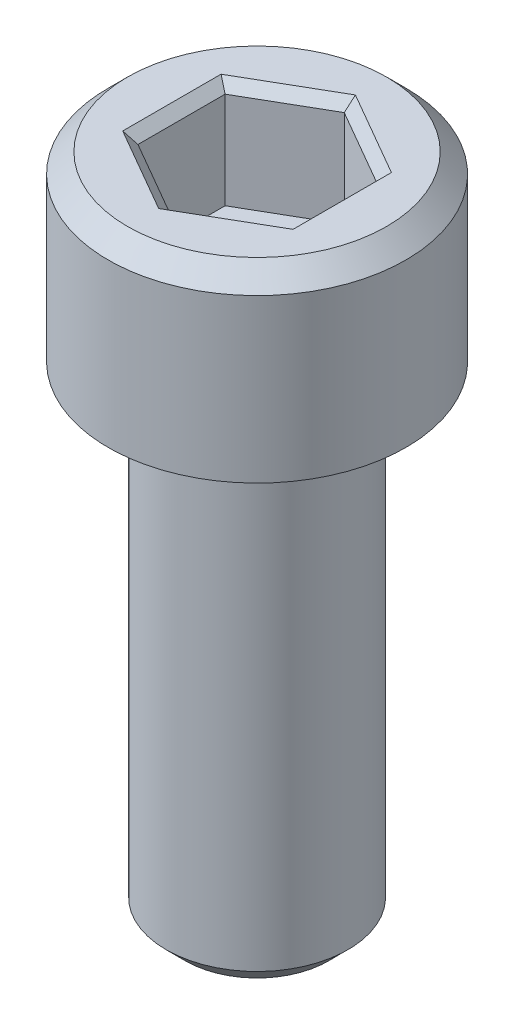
ISO-10303-21;
HEADER;
FILE_DESCRIPTION(('STEP AP214'),'2;1');
FILE_NAME('part.step','',(''),(''),'','','');
FILE_SCHEMA(('AUTOMOTIVE_DESIGN { 1 0 10303 214 1 1 1 1 }'));
ENDSEC;
DATA;
#1=APPLICATION_CONTEXT('core data for automotive mechanical design processes');
#2=APPLICATION_PROTOCOL_DEFINITION('international standard','automotive_design',2000,#1);
#3=PRODUCT_CONTEXT('',#1,'mechanical');
#4=PRODUCT('Part','Part','',(#3));
#5=PRODUCT_RELATED_PRODUCT_CATEGORY('part','',(#4));
#6=PRODUCT_DEFINITION_FORMATION('','',#4);
#7=PRODUCT_DEFINITION_CONTEXT('part definition',#1,'design');
#8=PRODUCT_DEFINITION('design','',#6,#7);
#9=PRODUCT_DEFINITION_SHAPE('','',#8);
#10=(LENGTH_UNIT() NAMED_UNIT(*) SI_UNIT(.MILLI.,.METRE.));
#11=(NAMED_UNIT(*) PLANE_ANGLE_UNIT() SI_UNIT($,.RADIAN.));
#12=(NAMED_UNIT(*) SI_UNIT($,.STERADIAN.) SOLID_ANGLE_UNIT());
#13=UNCERTAINTY_MEASURE_WITH_UNIT(LENGTH_MEASURE(1.E-05),#10,'distance_accuracy_value','');
#14=(GEOMETRIC_REPRESENTATION_CONTEXT(3) GLOBAL_UNCERTAINTY_ASSIGNED_CONTEXT((#13)) GLOBAL_UNIT_ASSIGNED_CONTEXT((#10,
#11,#12)) REPRESENTATION_CONTEXT('',''));
#15=CARTESIAN_POINT('',(0.,0.,0.));
#16=DIRECTION('',(0.,0.,1.));
#17=DIRECTION('',(1.,0.,0.));
#18=AXIS2_PLACEMENT_3D('',#15,#16,#17);
#19=CARTESIAN_POINT('',(-3.96874999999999,-2.794,0.));
#20=DIRECTION('',(0.,-1.,0.));
#21=DIRECTION('',(0.,0.,-1.));
#22=AXIS2_PLACEMENT_3D('',#19,#20,#21);
#23=PLANE('',#22);
#24=DIRECTION('',(-0.866025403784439,0.,0.5));
#25=VECTOR('',#24,1.);
#26=CARTESIAN_POINT('',(1.98437500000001,-2.794,1.14567944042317));
#27=LINE('',#26,#25);
#28=CARTESIAN_POINT('',(1.98437500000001,-2.794,1.14567944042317));
#29=VERTEX_POINT('',#28);
#30=CARTESIAN_POINT('',(0.,-2.794,2.29135888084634));
#31=VERTEX_POINT('',#30);
#32=EDGE_CURVE('E86',#29,#31,#27,.T.);
#33=ORIENTED_EDGE('',*,*,#32,.F.);
#34=DIRECTION('',(0.,0.,1.));
#35=VECTOR('',#34,1.);
#36=CARTESIAN_POINT('',(1.98437500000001,-2.794,-1.14567944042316));
#37=LINE('',#36,#35);
#38=CARTESIAN_POINT('',(1.98437500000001,-2.794,-1.14567944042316));
#39=VERTEX_POINT('',#38);
#40=EDGE_CURVE('E91',#39,#29,#37,.T.);
#41=ORIENTED_EDGE('',*,*,#40,.F.);
#42=DIRECTION('',(0.866025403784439,0.,0.5));
#43=VECTOR('',#42,1.);
#44=CARTESIAN_POINT('',(0.,-2.794,-2.29135888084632));
#45=LINE('',#44,#43);
#46=CARTESIAN_POINT('',(0.,-2.794,-2.29135888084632));
#47=VERTEX_POINT('',#46);
#48=EDGE_CURVE('E176',#47,#39,#45,.T.);
#49=ORIENTED_EDGE('',*,*,#48,.F.);
#50=DIRECTION('',(0.866025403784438,0.,-0.5));
#51=VECTOR('',#50,1.);
#52=CARTESIAN_POINT('',(-1.98437499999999,-2.794,-1.14567944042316));
#53=LINE('',#52,#51);
#54=CARTESIAN_POINT('',(-1.984375,-2.794,-1.14567944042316));
#55=VERTEX_POINT('',#54);
#56=EDGE_CURVE('E182',#55,#47,#53,.T.);
#57=ORIENTED_EDGE('',*,*,#56,.F.);
#58=DIRECTION('',(0.,0.,-1.));
#59=VECTOR('',#58,1.);
#60=CARTESIAN_POINT('',(-1.984375,-2.794,1.14567944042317));
#61=LINE('',#60,#59);
#62=CARTESIAN_POINT('',(-1.984375,-2.794,1.14567944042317));
#63=VERTEX_POINT('',#62);
#64=EDGE_CURVE('E187',#63,#55,#61,.T.);
#65=ORIENTED_EDGE('',*,*,#64,.F.);
#66=DIRECTION('',(-0.866025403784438,0.,-0.5));
#67=VECTOR('',#66,1.);
#68=CARTESIAN_POINT('',(0.,-2.794,2.29135888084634));
#69=LINE('',#68,#67);
#70=EDGE_CURVE('E102',#31,#63,#69,.T.);
#71=ORIENTED_EDGE('',*,*,#70,.F.);
#72=EDGE_LOOP('',(#33,#41,#49,#57,#65,#71));
#73=FACE_BOUND('',#72,.T.);
#74=ADVANCED_FACE('F17',(#73),#23,.F.);
#75=CARTESIAN_POINT('',(1.98437500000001,-2.794,-1.14567944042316));
#76=DIRECTION('',(-1.,0.,0.));
#77=DIRECTION('',(0.,0.,1.));
#78=AXIS2_PLACEMENT_3D('',#75,#76,#77);
#79=PLANE('',#78);
#80=DIRECTION('',(0.,1.,0.));
#81=VECTOR('',#80,1.);
#82=CARTESIAN_POINT('',(1.98437500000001,-2.794,-1.14567944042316));
#83=LINE('',#82,#81);
#84=CARTESIAN_POINT('',(1.98437500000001,-0.254,-1.14567944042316));
#85=VERTEX_POINT('',#84);
#86=EDGE_CURVE('E96',#39,#85,#83,.T.);
#87=ORIENTED_EDGE('',*,*,#86,.F.);
#88=ORIENTED_EDGE('',*,*,#40,.T.);
#89=DIRECTION('',(0.,1.,0.));
#90=VECTOR('',#89,1.);
#91=CARTESIAN_POINT('',(1.98437500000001,-2.794,1.14567944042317));
#92=LINE('',#91,#90);
#93=CARTESIAN_POINT('',(1.98437500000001,-0.254,1.14567944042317));
#94=VERTEX_POINT('',#93);
#95=EDGE_CURVE('E93',#94,#29,#92,.F.);
#96=ORIENTED_EDGE('',*,*,#95,.F.);
#97=DIRECTION('',(0.,0.,1.));
#98=VECTOR('',#97,1.);
#99=CARTESIAN_POINT('',(1.98437500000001,-0.254,0.));
#100=LINE('',#99,#98);
#101=EDGE_CURVE('E174',#94,#85,#100,.F.);
#102=ORIENTED_EDGE('',*,*,#101,.T.);
#103=EDGE_LOOP('',(#87,#88,#96,#102));
#104=FACE_BOUND('',#103,.T.);
#105=ADVANCED_FACE('F92',(#104),#79,.T.);
#106=CARTESIAN_POINT('',(1.98437500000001,-2.794,1.14567944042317));
#107=DIRECTION('',(-0.5,0.,-0.866025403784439));
#108=DIRECTION('',(-0.866025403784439,0.,0.5));
#109=AXIS2_PLACEMENT_3D('',#106,#107,#108);
#110=PLANE('',#109);
#111=ORIENTED_EDGE('',*,*,#95,.T.);
#112=ORIENTED_EDGE('',*,*,#32,.T.);
#113=DIRECTION('',(0.,1.,0.));
#114=VECTOR('',#113,1.);
#115=CARTESIAN_POINT('',(0.,-2.794,2.29135888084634));
#116=LINE('',#115,#114);
#117=CARTESIAN_POINT('',(0.,-0.253999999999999,2.29135888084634));
#118=VERTEX_POINT('',#117);
#119=EDGE_CURVE('E104',#118,#31,#116,.F.);
#120=ORIENTED_EDGE('',*,*,#119,.F.);
#121=DIRECTION('',(0.866025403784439,0.,-0.5));
#122=VECTOR('',#121,1.);
#123=CARTESIAN_POINT('',(0.,-0.253999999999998,2.29135888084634));
#124=LINE('',#123,#122);
#125=EDGE_CURVE('E108',#118,#94,#124,.T.);
#126=ORIENTED_EDGE('',*,*,#125,.T.);
#127=EDGE_LOOP('',(#111,#112,#120,#126));
#128=FACE_BOUND('',#127,.T.);
#129=ADVANCED_FACE('F106',(#128),#110,.T.);
#130=CARTESIAN_POINT('',(0.,-2.794,2.29135888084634));
#131=DIRECTION('',(0.5,0.,-0.866025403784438));
#132=DIRECTION('',(-0.866025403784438,0.,-0.5));
#133=AXIS2_PLACEMENT_3D('',#130,#131,#132);
#134=PLANE('',#133);
#135=ORIENTED_EDGE('',*,*,#119,.T.);
#136=ORIENTED_EDGE('',*,*,#70,.T.);
#137=DIRECTION('',(0.,1.,0.));
#138=VECTOR('',#137,1.);
#139=CARTESIAN_POINT('',(-1.984375,-2.794,1.14567944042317));
#140=LINE('',#139,#138);
#141=CARTESIAN_POINT('',(-1.984375,-0.254,1.14567944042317));
#142=VERTEX_POINT('',#141);
#143=EDGE_CURVE('E189',#142,#63,#140,.F.);
#144=ORIENTED_EDGE('',*,*,#143,.F.);
#145=DIRECTION('',(0.866025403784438,0.,0.500000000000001));
#146=VECTOR('',#145,1.);
#147=CARTESIAN_POINT('',(-1.984375,-0.254,1.14567944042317));
#148=LINE('',#147,#146);
#149=EDGE_CURVE('E168',#142,#118,#148,.T.);
#150=ORIENTED_EDGE('',*,*,#149,.T.);
#151=EDGE_LOOP('',(#135,#136,#144,#150));
#152=FACE_BOUND('',#151,.T.);
#153=ADVANCED_FACE('F193',(#152),#134,.T.);
#154=CARTESIAN_POINT('',(-1.984375,-2.794,1.14567944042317));
#155=DIRECTION('',(1.,0.,0.));
#156=DIRECTION('',(0.,0.,-1.));
#157=AXIS2_PLACEMENT_3D('',#154,#155,#156);
#158=PLANE('',#157);
#159=ORIENTED_EDGE('',*,*,#143,.T.);
#160=ORIENTED_EDGE('',*,*,#64,.T.);
#161=DIRECTION('',(0.,1.,0.));
#162=VECTOR('',#161,1.);
#163=CARTESIAN_POINT('',(-1.984375,-2.794,-1.14567944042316));
#164=LINE('',#163,#162);
#165=CARTESIAN_POINT('',(-1.984375,-0.253999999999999,-1.14567944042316));
#166=VERTEX_POINT('',#165);
#167=EDGE_CURVE('E184',#166,#55,#164,.F.);
#168=ORIENTED_EDGE('',*,*,#167,.F.);
#169=DIRECTION('',(0.,0.,1.));
#170=VECTOR('',#169,1.);
#171=CARTESIAN_POINT('',(-1.984375,-0.254,0.));
#172=LINE('',#171,#170);
#173=EDGE_CURVE('E163',#166,#142,#172,.T.);
#174=ORIENTED_EDGE('',*,*,#173,.T.);
#175=EDGE_LOOP('',(#159,#160,#168,#174));
#176=FACE_BOUND('',#175,.T.);
#177=ADVANCED_FACE('F223',(#176),#158,.T.);
#178=CARTESIAN_POINT('',(-1.98437499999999,-2.794,-1.14567944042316));
#179=DIRECTION('',(0.5,0.,0.866025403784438));
#180=DIRECTION('',(0.866025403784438,0.,-0.5));
#181=AXIS2_PLACEMENT_3D('',#178,#179,#180);
#182=PLANE('',#181);
#183=ORIENTED_EDGE('',*,*,#167,.T.);
#184=ORIENTED_EDGE('',*,*,#56,.T.);
#185=DIRECTION('',(0.,1.,0.));
#186=VECTOR('',#185,1.);
#187=CARTESIAN_POINT('',(0.,-2.794,-2.29135888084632));
#188=LINE('',#187,#186);
#189=CARTESIAN_POINT('',(0.,-0.254,-2.29135888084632));
#190=VERTEX_POINT('',#189);
#191=EDGE_CURVE('E178',#190,#47,#188,.F.);
#192=ORIENTED_EDGE('',*,*,#191,.F.);
#193=DIRECTION('',(-0.866025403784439,0.,0.499999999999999));
#194=VECTOR('',#193,1.);
#195=CARTESIAN_POINT('',(0.,-0.253999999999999,-2.29135888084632));
#196=LINE('',#195,#194);
#197=EDGE_CURVE('E158',#190,#166,#196,.T.);
#198=ORIENTED_EDGE('',*,*,#197,.T.);
#199=EDGE_LOOP('',(#183,#184,#192,#198));
#200=FACE_BOUND('',#199,.T.);
#201=ADVANCED_FACE('F219',(#200),#182,.T.);
#202=CARTESIAN_POINT('',(0.,-2.794,-2.29135888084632));
#203=DIRECTION('',(-0.5,0.,0.866025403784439));
#204=DIRECTION('',(0.866025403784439,0.,0.5));
#205=AXIS2_PLACEMENT_3D('',#202,#203,#204);
#206=PLANE('',#205);
#207=ORIENTED_EDGE('',*,*,#191,.T.);
#208=ORIENTED_EDGE('',*,*,#48,.T.);
#209=ORIENTED_EDGE('',*,*,#86,.T.);
#210=DIRECTION('',(-0.866025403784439,0.,-0.499999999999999));
#211=VECTOR('',#210,1.);
#212=CARTESIAN_POINT('',(1.98437500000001,-0.253999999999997,-1.14567944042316));
#213=LINE('',#212,#211);
#214=EDGE_CURVE('E150',#85,#190,#213,.T.);
#215=ORIENTED_EDGE('',*,*,#214,.T.);
#216=EDGE_LOOP('',(#207,#208,#209,#215));
#217=FACE_BOUND('',#216,.T.);
#218=ADVANCED_FACE('F214',(#217),#206,.T.);
#219=CARTESIAN_POINT('',(2.23837500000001,0.,0.));
#220=DIRECTION('',(0.707106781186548,-0.707106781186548,0.));
#221=DIRECTION('',(0.707106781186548,0.707106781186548,0.));
#222=AXIS2_PLACEMENT_3D('',#219,#220,#221);
#223=PLANE('',#222);
#224=ORIENTED_EDGE('',*,*,#101,.F.);
#225=DIRECTION('',(0.654653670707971,0.654653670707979,0.377964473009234));
#226=VECTOR('',#225,1.);
#227=CARTESIAN_POINT('',(1.98437500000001,-0.254,1.14567944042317));
#228=LINE('',#227,#226);
#229=CARTESIAN_POINT('',(2.23837500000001,0.,1.29232640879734));
#230=VERTEX_POINT('',#229);
#231=EDGE_CURVE('E171',#94,#230,#228,.T.);
#232=ORIENTED_EDGE('',*,*,#231,.T.);
#233=DIRECTION('',(0.,0.,1.));
#234=VECTOR('',#233,1.);
#235=CARTESIAN_POINT('',(2.23837500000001,0.,0.));
#236=LINE('',#235,#234);
#237=CARTESIAN_POINT('',(2.23837500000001,0.,-1.29232640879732));
#238=VERTEX_POINT('',#237);
#239=EDGE_CURVE('E146',#238,#230,#236,.T.);
#240=ORIENTED_EDGE('',*,*,#239,.F.);
#241=DIRECTION('',(-0.654653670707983,-0.654653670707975,0.377964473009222));
#242=VECTOR('',#241,1.);
#243=CARTESIAN_POINT('',(2.23837500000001,0.,-1.29232640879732));
#244=LINE('',#243,#242);
#245=EDGE_CURVE('E153',#238,#85,#244,.T.);
#246=ORIENTED_EDGE('',*,*,#245,.T.);
#247=EDGE_LOOP('',(#224,#232,#240,#246));
#248=FACE_BOUND('',#247,.T.);
#249=ADVANCED_FACE('F209',(#248),#223,.F.);
#250=CARTESIAN_POINT('',(1.11918750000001,0.,1.938489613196));
#251=DIRECTION('',(0.353553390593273,-0.707106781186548,0.612372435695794));
#252=DIRECTION('',(0.,-0.654653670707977,-0.755928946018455));
#253=AXIS2_PLACEMENT_3D('',#250,#251,#252);
#254=PLANE('',#253);
#255=ORIENTED_EDGE('',*,*,#125,.F.);
#256=DIRECTION('',(0.,-0.654653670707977,-0.755928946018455));
#257=VECTOR('',#256,1.);
#258=CARTESIAN_POINT('',(0.,-0.319767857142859,2.21541670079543));
#259=LINE('',#258,#257);
#260=CARTESIAN_POINT('',(0.,0.,2.58465281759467));
#261=VERTEX_POINT('',#260);
#262=EDGE_CURVE('E166',#118,#261,#259,.F.);
#263=ORIENTED_EDGE('',*,*,#262,.T.);
#264=DIRECTION('',(-0.866025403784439,0.,0.5));
#265=VECTOR('',#264,1.);
#266=CARTESIAN_POINT('',(2.23837500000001,0.,1.29232640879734));
#267=LINE('',#266,#265);
#268=EDGE_CURVE('E143',#230,#261,#267,.T.);
#269=ORIENTED_EDGE('',*,*,#268,.F.);
#270=ORIENTED_EDGE('',*,*,#231,.F.);
#271=EDGE_LOOP('',(#255,#263,#269,#270));
#272=FACE_BOUND('',#271,.T.);
#273=ADVANCED_FACE('F200',(#272),#254,.F.);
#274=CARTESIAN_POINT('',(-1.1191875,0.,1.938489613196));
#275=DIRECTION('',(-0.353553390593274,-0.707106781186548,0.612372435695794));
#276=DIRECTION('',(0.,-0.654653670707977,-0.755928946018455));
#277=AXIS2_PLACEMENT_3D('',#274,#275,#276);
#278=PLANE('',#277);
#279=DIRECTION('',(-0.866025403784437,0.,-0.500000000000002));
#280=VECTOR('',#279,1.);
#281=CARTESIAN_POINT('',(0.,0.,2.58465281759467));
#282=LINE('',#281,#280);
#283=CARTESIAN_POINT('',(-2.238375,0.,1.29232640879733));
#284=VERTEX_POINT('',#283);
#285=EDGE_CURVE('E140',#261,#284,#282,.T.);
#286=ORIENTED_EDGE('',*,*,#285,.F.);
#287=ORIENTED_EDGE('',*,*,#262,.F.);
#288=ORIENTED_EDGE('',*,*,#149,.F.);
#289=DIRECTION('',(-0.65465367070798,0.65465367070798,0.377964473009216));
#290=VECTOR('',#289,1.);
#291=CARTESIAN_POINT('',(-1.984375,-0.254,1.14567944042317));
#292=LINE('',#291,#290);
#293=EDGE_CURVE('E161',#142,#284,#292,.T.);
#294=ORIENTED_EDGE('',*,*,#293,.T.);
#295=EDGE_LOOP('',(#286,#287,#288,#294));
#296=FACE_BOUND('',#295,.T.);
#297=ADVANCED_FACE('F203',(#296),#278,.F.);
#298=CARTESIAN_POINT('',(-2.238375,0.,0.));
#299=DIRECTION('',(-0.707106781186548,-0.707106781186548,0.));
#300=DIRECTION('',(0.707106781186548,-0.707106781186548,0.));
#301=AXIS2_PLACEMENT_3D('',#298,#299,#300);
#302=PLANE('',#301);
#303=DIRECTION('',(0.,0.,1.));
#304=VECTOR('',#303,1.);
#305=CARTESIAN_POINT('',(-2.238375,0.,0.));
#306=LINE('',#305,#304);
#307=CARTESIAN_POINT('',(-2.238375,0.,-1.29232640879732));
#308=VERTEX_POINT('',#307);
#309=EDGE_CURVE('E137',#284,#308,#306,.F.);
#310=ORIENTED_EDGE('',*,*,#309,.F.);
#311=ORIENTED_EDGE('',*,*,#293,.F.);
#312=ORIENTED_EDGE('',*,*,#173,.F.);
#313=DIRECTION('',(-0.654653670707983,0.654653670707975,-0.377964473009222));
#314=VECTOR('',#313,1.);
#315=CARTESIAN_POINT('',(-1.984375,-0.253999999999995,-1.14567944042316));
#316=LINE('',#315,#314);
#317=EDGE_CURVE('E156',#166,#308,#316,.T.);
#318=ORIENTED_EDGE('',*,*,#317,.T.);
#319=EDGE_LOOP('',(#310,#311,#312,#318));
#320=FACE_BOUND('',#319,.T.);
#321=ADVANCED_FACE('F221',(#320),#302,.F.);
#322=CARTESIAN_POINT('',(-1.1191875,0.,-1.93848961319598));
#323=DIRECTION('',(-0.353553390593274,-0.707106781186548,-0.612372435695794));
#324=DIRECTION('',(0.,0.654653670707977,-0.755928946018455));
#325=AXIS2_PLACEMENT_3D('',#322,#323,#324);
#326=PLANE('',#325);
#327=ORIENTED_EDGE('',*,*,#197,.F.);
#328=DIRECTION('',(0.,0.654653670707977,-0.755928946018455));
#329=VECTOR('',#328,1.);
#330=CARTESIAN_POINT('',(0.,-0.319767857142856,-2.21541670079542));
#331=LINE('',#330,#329);
#332=CARTESIAN_POINT('',(0.,0.,-2.58465281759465));
#333=VERTEX_POINT('',#332);
#334=EDGE_CURVE('E35',#190,#333,#331,.T.);
#335=ORIENTED_EDGE('',*,*,#334,.T.);
#336=DIRECTION('',(0.866025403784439,0.,-0.499999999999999));
#337=VECTOR('',#336,1.);
#338=CARTESIAN_POINT('',(-2.238375,0.,-1.29232640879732));
#339=LINE('',#338,#337);
#340=EDGE_CURVE('E134',#308,#333,#339,.T.);
#341=ORIENTED_EDGE('',*,*,#340,.F.);
#342=ORIENTED_EDGE('',*,*,#317,.F.);
#343=EDGE_LOOP('',(#327,#335,#341,#342));
#344=FACE_BOUND('',#343,.T.);
#345=ADVANCED_FACE('F216',(#344),#326,.F.);
#346=CARTESIAN_POINT('',(1.1191875,0.,-1.93848961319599));
#347=DIRECTION('',(0.353553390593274,-0.707106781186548,-0.612372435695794));
#348=DIRECTION('',(0.,0.654653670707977,-0.755928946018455));
#349=AXIS2_PLACEMENT_3D('',#346,#347,#348);
#350=PLANE('',#349);
#351=ORIENTED_EDGE('',*,*,#214,.F.);
#352=ORIENTED_EDGE('',*,*,#245,.F.);
#353=DIRECTION('',(0.866025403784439,0.,0.5));
#354=VECTOR('',#353,1.);
#355=CARTESIAN_POINT('',(0.,0.,-2.58465281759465));
#356=LINE('',#355,#354);
#357=EDGE_CURVE('E125',#333,#238,#356,.T.);
#358=ORIENTED_EDGE('',*,*,#357,.F.);
#359=ORIENTED_EDGE('',*,*,#334,.F.);
#360=EDGE_LOOP('',(#351,#352,#358,#359));
#361=FACE_BOUND('',#360,.T.);
#362=ADVANCED_FACE('F212',(#361),#350,.F.);
#363=CARTESIAN_POINT('',(0.,0.,0.));
#364=DIRECTION('',(0.,1.,0.));
#365=DIRECTION('',(0.,0.,1.));
#366=AXIS2_PLACEMENT_3D('',#363,#364,#365);
#367=PLANE('',#366);
#368=CARTESIAN_POINT('',(0.,0.,0.));
#369=DIRECTION('',(0.,-1.,0.));
#370=DIRECTION('',(0.,0.,-1.));
#371=AXIS2_PLACEMENT_3D('',#368,#369,#370);
#372=CIRCLE('',#371,3.40360000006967);
#373=CARTESIAN_POINT('',(0.,0.,-3.40360000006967));
#374=VERTEX_POINT('',#373);
#375=EDGE_CURVE('E20',#374,#374,#372,.T.);
#376=ORIENTED_EDGE('',*,*,#375,.F.);
#377=EDGE_LOOP('',(#376));
#378=FACE_BOUND('',#377,.T.);
#379=ORIENTED_EDGE('',*,*,#340,.T.);
#380=ORIENTED_EDGE('',*,*,#357,.T.);
#381=ORIENTED_EDGE('',*,*,#239,.T.);
#382=ORIENTED_EDGE('',*,*,#268,.T.);
#383=ORIENTED_EDGE('',*,*,#285,.T.);
#384=ORIENTED_EDGE('',*,*,#309,.T.);
#385=EDGE_LOOP('',(#379,#380,#381,#382,#383,#384));
#386=FACE_BOUND('',#385,.T.);
#387=ADVANCED_FACE('F206',(#378,#386),#367,.T.);
#388=CARTESIAN_POINT('',(0.,-0.507999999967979,0.));
#389=DIRECTION('',(0.,-1.,0.));
#390=DIRECTION('',(0.,0.,-1.));
#391=AXIS2_PLACEMENT_3D('',#388,#389,#390);
#392=CONICAL_SURFACE('',#391,3.91160000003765,0.785398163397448);
#393=ORIENTED_EDGE('',*,*,#375,.T.);
#394=EDGE_LOOP('',(#393));
#395=FACE_BOUND('',#394,.T.);
#396=CARTESIAN_POINT('',(0.,-0.508,0.));
#397=DIRECTION('',(0.,-1.,0.));
#398=DIRECTION('',(0.,0.,-1.));
#399=AXIS2_PLACEMENT_3D('',#396,#397,#398);
#400=CIRCLE('',#399,3.9116);
#401=CARTESIAN_POINT('',(0.,-0.508,-3.9116));
#402=VERTEX_POINT('',#401);
#403=EDGE_CURVE('E117',#402,#402,#400,.T.);
#404=ORIENTED_EDGE('',*,*,#403,.F.);
#405=EDGE_LOOP('',(#404));
#406=FACE_BOUND('',#405,.T.);
#407=ADVANCED_FACE('F257',(#395,#406),#392,.T.);
#408=CARTESIAN_POINT('',(0.,-17.4752,0.));
#409=DIRECTION('',(0.,1.,0.));
#410=DIRECTION('',(0.,0.,1.));
#411=AXIS2_PLACEMENT_3D('',#408,#409,#410);
#412=PLANE('',#411);
#413=CARTESIAN_POINT('',(0.,-17.4752000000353,0.));
#414=DIRECTION('',(0.,1.,0.));
#415=DIRECTION('',(0.,0.,1.));
#416=AXIS2_PLACEMENT_3D('',#413,#414,#415);
#417=CIRCLE('',#416,1.87959999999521);
#418=CARTESIAN_POINT('',(0.,-17.4752000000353,1.87959999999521));
#419=VERTEX_POINT('',#418);
#420=EDGE_CURVE('E115',#419,#419,#417,.T.);
#421=ORIENTED_EDGE('',*,*,#420,.F.);
#422=EDGE_LOOP('',(#421));
#423=FACE_BOUND('',#422,.T.);
#424=ADVANCED_FACE('F253',(#423),#412,.F.);
#425=CARTESIAN_POINT('',(0.,-4.7752,0.));
#426=DIRECTION('',(0.,-1.,0.));
#427=DIRECTION('',(0.,0.,-1.));
#428=AXIS2_PLACEMENT_3D('',#425,#426,#427);
#429=CYLINDRICAL_SURFACE('',#428,3.9116);
#430=CARTESIAN_POINT('',(0.,-4.7752,0.));
#431=DIRECTION('',(0.,-1.,0.));
#432=DIRECTION('',(0.,0.,-1.));
#433=AXIS2_PLACEMENT_3D('',#430,#431,#432);
#434=CIRCLE('',#433,3.9116);
#435=CARTESIAN_POINT('',(0.,-4.7752,-3.9116));
#436=VERTEX_POINT('',#435);
#437=EDGE_CURVE('E113',#436,#436,#434,.F.);
#438=ORIENTED_EDGE('',*,*,#437,.T.);
#439=EDGE_LOOP('',(#438));
#440=FACE_BOUND('',#439,.T.);
#441=ORIENTED_EDGE('',*,*,#403,.T.);
#442=EDGE_LOOP('',(#441));
#443=FACE_BOUND('',#442,.T.);
#444=ADVANCED_FACE('F249',(#440,#443),#429,.T.);
#445=CARTESIAN_POINT('',(0.,-16.9672000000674,0.));
#446=DIRECTION('',(0.,1.,0.));
#447=DIRECTION('',(0.,0.,1.));
#448=AXIS2_PLACEMENT_3D('',#445,#446,#447);
#449=CONICAL_SURFACE('',#448,2.38759999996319,0.785398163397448);
#450=CARTESIAN_POINT('',(0.,-16.9672,0.));
#451=DIRECTION('',(0.,-1.,0.));
#452=DIRECTION('',(0.,0.,-1.));
#453=AXIS2_PLACEMENT_3D('',#450,#451,#452);
#454=CIRCLE('',#453,2.3876);
#455=CARTESIAN_POINT('',(0.,-16.9672,-2.3876));
#456=VERTEX_POINT('',#455);
#457=EDGE_CURVE('E26',#456,#456,#454,.F.);
#458=ORIENTED_EDGE('',*,*,#457,.F.);
#459=EDGE_LOOP('',(#458));
#460=FACE_BOUND('',#459,.T.);
#461=ORIENTED_EDGE('',*,*,#420,.T.);
#462=EDGE_LOOP('',(#461));
#463=FACE_BOUND('',#462,.T.);
#464=ADVANCED_FACE('F242',(#460,#463),#449,.T.);
#465=CARTESIAN_POINT('',(0.,-4.7752,0.));
#466=DIRECTION('',(0.,1.,0.));
#467=DIRECTION('',(0.,0.,1.));
#468=AXIS2_PLACEMENT_3D('',#465,#466,#467);
#469=PLANE('',#468);
#470=ORIENTED_EDGE('',*,*,#437,.F.);
#471=EDGE_LOOP('',(#470));
#472=FACE_BOUND('',#471,.T.);
#473=CARTESIAN_POINT('',(0.,-4.7752,0.));
#474=DIRECTION('',(0.,-1.,0.));
#475=DIRECTION('',(0.,0.,-1.));
#476=AXIS2_PLACEMENT_3D('',#473,#474,#475);
#477=CIRCLE('',#476,2.3876);
#478=CARTESIAN_POINT('',(0.,-4.7752,-2.3876));
#479=VERTEX_POINT('',#478);
#480=EDGE_CURVE('E11',#479,#479,#477,.T.);
#481=ORIENTED_EDGE('',*,*,#480,.F.);
#482=EDGE_LOOP('',(#481));
#483=FACE_BOUND('',#482,.T.);
#484=ADVANCED_FACE('F236',(#472,#483),#469,.F.);
#485=CARTESIAN_POINT('',(0.,-17.4752,0.));
#486=DIRECTION('',(0.,-1.,0.));
#487=DIRECTION('',(0.,0.,-1.));
#488=AXIS2_PLACEMENT_3D('',#485,#486,#487);
#489=CYLINDRICAL_SURFACE('',#488,2.3876);
#490=ORIENTED_EDGE('',*,*,#480,.T.);
#491=EDGE_LOOP('',(#490));
#492=FACE_BOUND('',#491,.T.);
#493=ORIENTED_EDGE('',*,*,#457,.T.);
#494=EDGE_LOOP('',(#493));
#495=FACE_BOUND('',#494,.T.);
#496=ADVANCED_FACE('F234',(#492,#495),#489,.T.);
#497=CLOSED_SHELL('',(#74,#105,#129,#153,#177,#201,#218,#249,#273,#297,#321,#345,#362,#387,#407,
#424,#444,#464,#484,#496));
#498=MANIFOLD_SOLID_BREP('B1',#497);
#499=ADVANCED_BREP_SHAPE_REPRESENTATION('',(#18,#498),#14);
#500=SHAPE_DEFINITION_REPRESENTATION(#9,#499);
ENDSEC;
END-ISO-10303-21;
